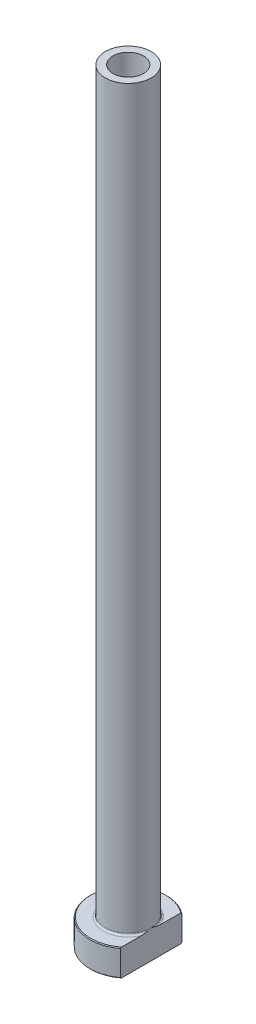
from build123d import *

# Parameters (mm, degrees)
FILLET1_R          = 0.5
CHAMFER1_SIZE      = 0.2
CUT_EXTRUDE1_DEPTH = 201.499376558
CHAMFER2_SIZE      = 0.5


with BuildPart() as part:
    # Sketch1 → Revolve1 (revolve)
    with BuildSketch(Plane.XY, mode=Mode.PRIVATE) as revolve1_sk:
        Polygon((-4, 200), (-6, 200), (-6, 7), (-10, 7), (-10, 0), (-4.25, 0), (-4.25, 143), (-4, 155), align=None)
    revolve(revolve1_sk.sketch.rotate(Axis((0, 92.187680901, 0), (0, -1, 0)), 270), axis=Axis((0, 92.187680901, 0), (0, -1, 0)))

    # Fillet1
    fillet1_edges = [part.edges().sort_by_distance(p)[0] for p in [
        (0, 7, -6),
    ]]
    fillet(fillet1_edges, radius=FILLET1_R)

    # Chamfer1
    chamfer1_edges = [part.edges().sort_by_distance(p)[0] for p in [
        (0, 0, -10),
        (0, 7, -10),
    ]]
    chamfer(chamfer1_edges, length=CHAMFER1_SIZE)

    # Sketch2 → Cut-Extrude1 (cut, through all)
    with BuildSketch(Plane.XZ):
        with BuildLine():
            Line((6, 8), (6, -8))
            ThreePointArc((6, -8), (10, 0), (6, 8))
        make_face()
    extrude(amount=-CUT_EXTRUDE1_DEPTH, mode=Mode.SUBTRACT)

    # Chamfer2
    chamfer2_edges = [part.edges().sort_by_distance(p)[0] for p in [
        (0, 0, -4.25),
    ]]
    chamfer(chamfer2_edges, length=CHAMFER2_SIZE)


solid = part.part
